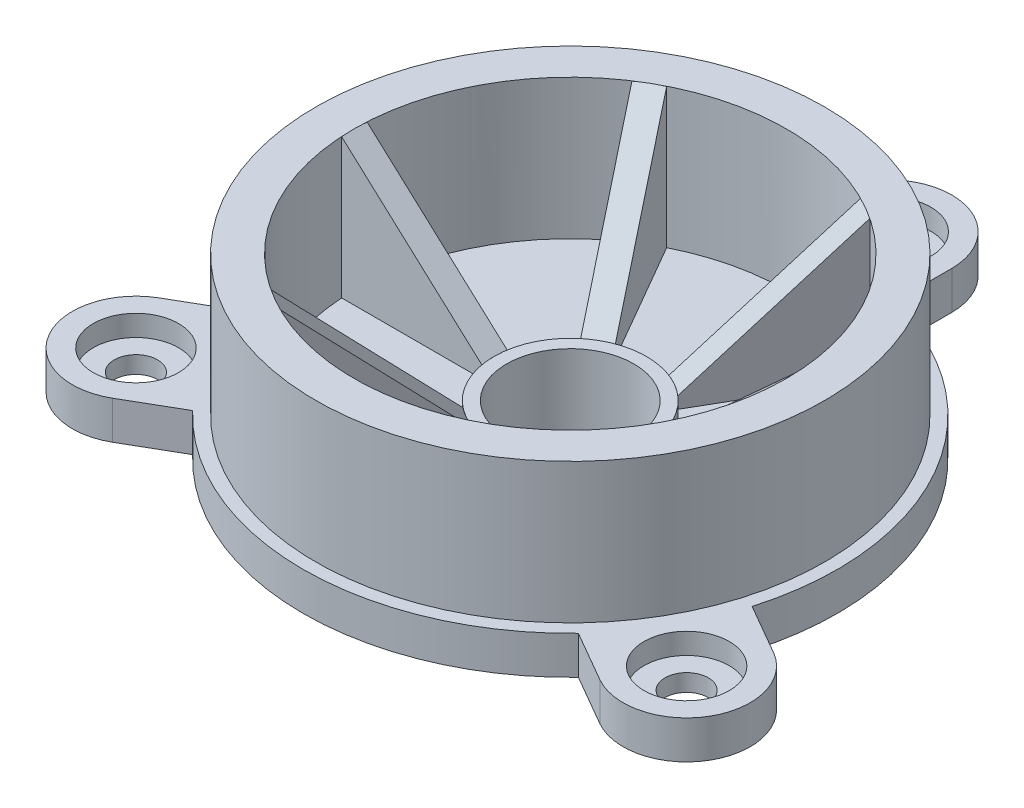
from build123d import *

# Parameters (mm, degrees)
EXTRUDE1_DEPTH                  = 3
CBORE_FOR_M3_SBHCS1_D           = 3.4
CBORE_FOR_M3_SBHCS1_CBORE_D     = 6.7
CBORE_FOR_M3_SBHCS1_CBORE_DEPTH = 1.65
CIRPATTERN1_COUNT               = 3
RIB1_REACH                      = 45.2
SKETCH5_WALL_W                  = 103.26644724
SKETCH5_WALL_H                  = 2
CIRPATTERN2_COUNT               = 6


with BuildPart() as part:
    # Sketch1 → Revolve1 (revolve)
    with BuildSketch(Plane(origin=(0, 0, 0), x_dir=(0, 0, -1), z_dir=(1, 0, 0))):
        Polygon((5, 0), (10, 0), (10, 2), (21, 2), (21, 5), (20, 5), (20, 16), (17, 16), (17, 5), (6, 5), (6, 6), (5, 6), align=None)
    revolve(axis=Axis((0, 0, 0), (0, 1, 0)))

    # Sketch2 → Extrude1 (add)
    with BuildSketch(Plane(origin=(0, 5, 0), x_dir=(1, 0, 0), z_dir=(0, 1, 0))):
        with BuildLine():
            Line((5, 20.396078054), (5, 25))
            ThreePointArc((5, 25), (0, 30), (-5, 25))
            Line((-5, 25), (-5, 20.396078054))
            ThreePointArc((-5, 20.396078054), (0, 21), (5, 20.396078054))
        make_face()
    extrude1 = extrude(amount=-EXTRUDE1_DEPTH)

    # CBORE for M3 SBHCS1 (through all)
    with Locations(Plane(origin=(0, 5, 0), x_dir=(-1, 0, 0), z_dir=(0, 1, 0))):
        with Locations((0, -25)):
            cbore_for_m3_sbhcs1 = CounterBoreHole(CBORE_FOR_M3_SBHCS1_D / 2, CBORE_FOR_M3_SBHCS1_CBORE_D / 2, CBORE_FOR_M3_SBHCS1_CBORE_DEPTH)

    # CirPattern1: Extrude1, CBORE for M3 SBHCS1 ×3 about axis
    cirpattern1_axis = Axis((0, 0, 0), (0, 1, 0))
    add([extrude1.rotate(cirpattern1_axis, i * 360 / CIRPATTERN1_COUNT) for i in range(1, CIRPATTERN1_COUNT)])
    add([cbore_for_m3_sbhcs1.rotate(cirpattern1_axis, i * 360 / CIRPATTERN1_COUNT) for i in range(1, CIRPATTERN1_COUNT)], mode=Mode.SUBTRACT)

    # Sketch5 wall → Rib1 (add, up to next)
    with BuildSketch(Plane(origin=(-11.5, 11, 0), x_dir=(0.739940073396, -0.672672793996, 0), z_dir=(0.672672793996, 0.739940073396, 0)), mode=Mode.PRIVATE) as rib1_sk1:
        Rectangle(SKETCH5_WALL_W, SKETCH5_WALL_H)
    rib1_tool1 = extrude(rib1_sk1.sketch, amount=-RIB1_REACH, mode=Mode.PRIVATE) - part.part
    rib1 = rib1_tool1.solids().sort_by_distance((-11.5, 11, 0))[0]
    add(rib1)

    # CirPattern2: Rib1 ×6 about axis
    cirpattern2_axis = Axis((0, 0, 0), (0, 1, 0))
    for i in range(1, CIRPATTERN2_COUNT):
        add(rib1.rotate(cirpattern2_axis, i * 360 / CIRPATTERN2_COUNT))


solid = part.part
